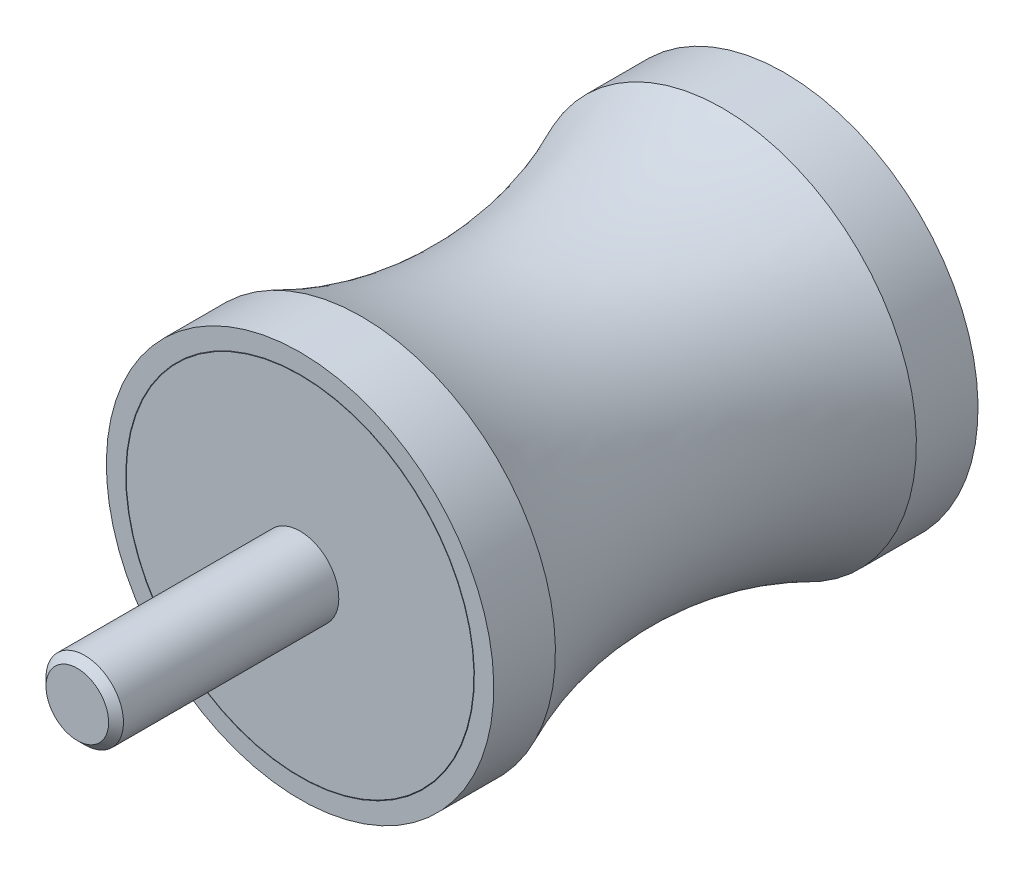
ISO-10303-21;
HEADER;
FILE_DESCRIPTION(('STEP AP214'),'2;1');
FILE_NAME('part.step','',(''),(''),'','','');
FILE_SCHEMA(('AUTOMOTIVE_DESIGN { 1 0 10303 214 1 1 1 1 }'));
ENDSEC;
DATA;
#1=APPLICATION_CONTEXT('core data for automotive mechanical design processes');
#2=APPLICATION_PROTOCOL_DEFINITION('international standard','automotive_design',2000,#1);
#3=PRODUCT_CONTEXT('',#1,'mechanical');
#4=PRODUCT('Part','Part','',(#3));
#5=PRODUCT_RELATED_PRODUCT_CATEGORY('part','',(#4));
#6=PRODUCT_DEFINITION_FORMATION('','',#4);
#7=PRODUCT_DEFINITION_CONTEXT('part definition',#1,'design');
#8=PRODUCT_DEFINITION('design','',#6,#7);
#9=PRODUCT_DEFINITION_SHAPE('','',#8);
#10=(LENGTH_UNIT() NAMED_UNIT(*) SI_UNIT(.MILLI.,.METRE.));
#11=(NAMED_UNIT(*) PLANE_ANGLE_UNIT() SI_UNIT($,.RADIAN.));
#12=(NAMED_UNIT(*) SI_UNIT($,.STERADIAN.) SOLID_ANGLE_UNIT());
#13=UNCERTAINTY_MEASURE_WITH_UNIT(LENGTH_MEASURE(1.E-05),#10,'distance_accuracy_value','');
#14=(GEOMETRIC_REPRESENTATION_CONTEXT(3) GLOBAL_UNCERTAINTY_ASSIGNED_CONTEXT((#13)) GLOBAL_UNIT_ASSIGNED_CONTEXT((#10,
#11,#12)) REPRESENTATION_CONTEXT('',''));
#15=CARTESIAN_POINT('',(0.,0.,0.));
#16=DIRECTION('',(0.,0.,1.));
#17=DIRECTION('',(1.,0.,0.));
#18=AXIS2_PLACEMENT_3D('',#15,#16,#17);
#19=CARTESIAN_POINT('',(0.,0.,0.5));
#20=DIRECTION('',(0.,0.,-1.));
#21=DIRECTION('',(0.,1.,0.));
#22=AXIS2_PLACEMENT_3D('',#19,#20,#21);
#23=CYLINDRICAL_SURFACE('',#22,18.);
#24=CARTESIAN_POINT('',(0.,0.,0.05));
#25=DIRECTION('',(0.,0.,-1.));
#26=DIRECTION('',(0.,1.,0.));
#27=AXIS2_PLACEMENT_3D('',#24,#25,#26);
#28=CIRCLE('',#27,18.);
#29=CARTESIAN_POINT('',(0.,18.,0.05));
#30=VERTEX_POINT('',#29);
#31=EDGE_CURVE('E53',#30,#30,#28,.T.);
#32=ORIENTED_EDGE('',*,*,#31,.F.);
#33=EDGE_LOOP('',(#32));
#34=FACE_BOUND('',#33,.T.);
#35=CARTESIAN_POINT('',(0.,0.,0.));
#36=DIRECTION('',(0.,0.,-1.));
#37=DIRECTION('',(0.,1.,0.));
#38=AXIS2_PLACEMENT_3D('',#35,#36,#37);
#39=CIRCLE('',#38,18.);
#40=CARTESIAN_POINT('',(0.,18.,0.));
#41=VERTEX_POINT('',#40);
#42=EDGE_CURVE('E44',#41,#41,#39,.T.);
#43=ORIENTED_EDGE('',*,*,#42,.T.);
#44=EDGE_LOOP('',(#43));
#45=FACE_BOUND('',#44,.T.);
#46=ADVANCED_FACE('F12',(#34,#45),#23,.F.);
#47=CARTESIAN_POINT('',(0.,0.,0.5));
#48=DIRECTION('',(0.,0.,-1.));
#49=DIRECTION('',(0.,1.,0.));
#50=AXIS2_PLACEMENT_3D('',#47,#48,#49);
#51=CYLINDRICAL_SURFACE('',#50,18.);
#52=CARTESIAN_POINT('',(0.,0.,50.));
#53=DIRECTION('',(0.,0.,-1.));
#54=DIRECTION('',(0.,1.,0.));
#55=AXIS2_PLACEMENT_3D('',#52,#53,#54);
#56=CIRCLE('',#55,18.);
#57=CARTESIAN_POINT('',(0.,18.,50.));
#58=VERTEX_POINT('',#57);
#59=EDGE_CURVE('E27',#58,#58,#56,.T.);
#60=ORIENTED_EDGE('',*,*,#59,.F.);
#61=EDGE_LOOP('',(#60));
#62=FACE_BOUND('',#61,.T.);
#63=CARTESIAN_POINT('',(0.,0.,49.95));
#64=DIRECTION('',(0.,0.,-1.));
#65=DIRECTION('',(0.,1.,0.));
#66=AXIS2_PLACEMENT_3D('',#63,#64,#65);
#67=CIRCLE('',#66,18.);
#68=CARTESIAN_POINT('',(0.,18.,49.95));
#69=VERTEX_POINT('',#68);
#70=EDGE_CURVE('E50',#69,#69,#67,.T.);
#71=ORIENTED_EDGE('',*,*,#70,.T.);
#72=EDGE_LOOP('',(#71));
#73=FACE_BOUND('',#72,.T.);
#74=ADVANCED_FACE('F89',(#62,#73),#51,.F.);
#75=CARTESIAN_POINT('',(18.,0.,50.));
#76=DIRECTION('',(0.,0.,-1.));
#77=DIRECTION('',(0.,1.,0.));
#78=AXIS2_PLACEMENT_3D('',#75,#76,#77);
#79=PLANE('',#78);
#80=CARTESIAN_POINT('',(0.,0.,50.));
#81=DIRECTION('',(0.,0.,-1.));
#82=DIRECTION('',(0.,1.,0.));
#83=AXIS2_PLACEMENT_3D('',#80,#81,#82);
#84=CIRCLE('',#83,20.);
#85=CARTESIAN_POINT('',(0.,20.,50.));
#86=VERTEX_POINT('',#85);
#87=EDGE_CURVE('E32',#86,#86,#84,.T.);
#88=ORIENTED_EDGE('',*,*,#87,.F.);
#89=EDGE_LOOP('',(#88));
#90=FACE_BOUND('',#89,.T.);
#91=ORIENTED_EDGE('',*,*,#59,.T.);
#92=EDGE_LOOP('',(#91));
#93=FACE_BOUND('',#92,.T.);
#94=ADVANCED_FACE('F115',(#90,#93),#79,.F.);
#95=CARTESIAN_POINT('',(0.,0.,0.5));
#96=DIRECTION('',(0.,0.,-1.));
#97=DIRECTION('',(0.,1.,0.));
#98=AXIS2_PLACEMENT_3D('',#95,#96,#97);
#99=CYLINDRICAL_SURFACE('',#98,20.);
#100=CARTESIAN_POINT('',(0.,0.,43.6338998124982));
#101=DIRECTION('',(0.,0.,-1.));
#102=DIRECTION('',(0.,1.,0.));
#103=AXIS2_PLACEMENT_3D('',#100,#101,#102);
#104=CIRCLE('',#103,20.);
#105=CARTESIAN_POINT('',(0.,20.,43.6338998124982));
#106=VERTEX_POINT('',#105);
#107=EDGE_CURVE('E35',#106,#106,#104,.T.);
#108=ORIENTED_EDGE('',*,*,#107,.F.);
#109=EDGE_LOOP('',(#108));
#110=FACE_BOUND('',#109,.T.);
#111=ORIENTED_EDGE('',*,*,#87,.T.);
#112=EDGE_LOOP('',(#111));
#113=FACE_BOUND('',#112,.T.);
#114=ADVANCED_FACE('F109',(#110,#113),#99,.T.);
#115=CARTESIAN_POINT('',(0.,0.,25.));
#116=DIRECTION('',(0.,0.,-1.));
#117=DIRECTION('',(0.,1.,0.));
#118=AXIS2_PLACEMENT_3D('',#115,#116,#117);
#119=TOROIDAL_SURFACE('',#118,61.4027777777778,45.4027777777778);
#120=CARTESIAN_POINT('',(0.,0.,6.36610018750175));
#121=DIRECTION('',(0.,0.,-1.));
#122=DIRECTION('',(0.,1.,0.));
#123=AXIS2_PLACEMENT_3D('',#120,#121,#122);
#124=CIRCLE('',#123,20.);
#125=CARTESIAN_POINT('',(0.,20.,6.36610018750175));
#126=VERTEX_POINT('',#125);
#127=EDGE_CURVE('E38',#126,#126,#124,.T.);
#128=ORIENTED_EDGE('',*,*,#127,.F.);
#129=EDGE_LOOP('',(#128));
#130=FACE_BOUND('',#129,.T.);
#131=ORIENTED_EDGE('',*,*,#107,.T.);
#132=EDGE_LOOP('',(#131));
#133=FACE_BOUND('',#132,.T.);
#134=ADVANCED_FACE('F103',(#130,#133),#119,.F.);
#135=CARTESIAN_POINT('',(0.,0.,0.5));
#136=DIRECTION('',(0.,0.,-1.));
#137=DIRECTION('',(0.,1.,0.));
#138=AXIS2_PLACEMENT_3D('',#135,#136,#137);
#139=CYLINDRICAL_SURFACE('',#138,20.);
#140=CARTESIAN_POINT('',(0.,0.,0.));
#141=DIRECTION('',(0.,0.,-1.));
#142=DIRECTION('',(0.,1.,0.));
#143=AXIS2_PLACEMENT_3D('',#140,#141,#142);
#144=CIRCLE('',#143,20.);
#145=CARTESIAN_POINT('',(0.,20.,0.));
#146=VERTEX_POINT('',#145);
#147=EDGE_CURVE('E41',#146,#146,#144,.T.);
#148=ORIENTED_EDGE('',*,*,#147,.F.);
#149=EDGE_LOOP('',(#148));
#150=FACE_BOUND('',#149,.T.);
#151=ORIENTED_EDGE('',*,*,#127,.T.);
#152=EDGE_LOOP('',(#151));
#153=FACE_BOUND('',#152,.T.);
#154=ADVANCED_FACE('F97',(#150,#153),#139,.T.);
#155=CARTESIAN_POINT('',(20.,0.,0.));
#156=DIRECTION('',(0.,0.,1.));
#157=DIRECTION('',(0.,-1.,0.));
#158=AXIS2_PLACEMENT_3D('',#155,#156,#157);
#159=PLANE('',#158);
#160=ORIENTED_EDGE('',*,*,#42,.F.);
#161=EDGE_LOOP('',(#160));
#162=FACE_BOUND('',#161,.T.);
#163=ORIENTED_EDGE('',*,*,#147,.T.);
#164=EDGE_LOOP('',(#163));
#165=FACE_BOUND('',#164,.T.);
#166=ADVANCED_FACE('F93',(#162,#165),#159,.F.);
#167=CARTESIAN_POINT('',(0.,0.,50.));
#168=DIRECTION('',(0.,0.,-1.));
#169=DIRECTION('',(0.,1.,0.));
#170=AXIS2_PLACEMENT_3D('',#167,#168,#169);
#171=PLANE('',#170);
#172=CARTESIAN_POINT('',(0.,0.,50.));
#173=DIRECTION('',(0.,0.,-1.));
#174=DIRECTION('',(0.,1.,0.));
#175=AXIS2_PLACEMENT_3D('',#172,#173,#174);
#176=CIRCLE('',#175,17.95);
#177=CARTESIAN_POINT('',(0.,17.95,50.));
#178=VERTEX_POINT('',#177);
#179=EDGE_CURVE('E47',#178,#178,#176,.T.);
#180=ORIENTED_EDGE('',*,*,#179,.F.);
#181=EDGE_LOOP('',(#180));
#182=FACE_BOUND('',#181,.T.);
#183=CARTESIAN_POINT('',(0.,0.,50.));
#184=DIRECTION('',(0.,0.,-1.));
#185=DIRECTION('',(0.,1.,0.));
#186=AXIS2_PLACEMENT_3D('',#183,#184,#185);
#187=CIRCLE('',#186,4.);
#188=CARTESIAN_POINT('',(0.,4.,50.));
#189=VERTEX_POINT('',#188);
#190=EDGE_CURVE('E8',#189,#189,#187,.T.);
#191=ORIENTED_EDGE('',*,*,#190,.T.);
#192=EDGE_LOOP('',(#191));
#193=FACE_BOUND('',#192,.T.);
#194=ADVANCED_FACE('F96',(#182,#193),#171,.F.);
#195=CARTESIAN_POINT('',(0.,0.,50.));
#196=DIRECTION('',(0.,0.,-1.));
#197=DIRECTION('',(0.,1.,0.));
#198=AXIS2_PLACEMENT_3D('',#195,#196,#197);
#199=CONICAL_SURFACE('',#198,17.95,0.785398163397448);
#200=ORIENTED_EDGE('',*,*,#70,.F.);
#201=EDGE_LOOP('',(#200));
#202=FACE_BOUND('',#201,.T.);
#203=ORIENTED_EDGE('',*,*,#179,.T.);
#204=EDGE_LOOP('',(#203));
#205=FACE_BOUND('',#204,.T.);
#206=ADVANCED_FACE('F129',(#202,#205),#199,.T.);
#207=CARTESIAN_POINT('',(0.,0.,73.));
#208=DIRECTION('',(0.,0.,-1.));
#209=DIRECTION('',(0.,1.,0.));
#210=AXIS2_PLACEMENT_3D('',#207,#208,#209);
#211=PLANE('',#210);
#212=CARTESIAN_POINT('',(0.,0.,73.));
#213=DIRECTION('',(0.,0.,-1.));
#214=DIRECTION('',(0.,1.,0.));
#215=AXIS2_PLACEMENT_3D('',#212,#213,#214);
#216=CIRCLE('',#215,3.233);
#217=CARTESIAN_POINT('',(0.,3.233,73.));
#218=VERTEX_POINT('',#217);
#219=EDGE_CURVE('E19',#218,#218,#216,.T.);
#220=ORIENTED_EDGE('',*,*,#219,.F.);
#221=EDGE_LOOP('',(#220));
#222=FACE_BOUND('',#221,.T.);
#223=ADVANCED_FACE('F14',(#222),#211,.F.);
#224=CARTESIAN_POINT('',(0.,0.,73.));
#225=DIRECTION('',(0.,0.,-1.));
#226=DIRECTION('',(0.,1.,0.));
#227=AXIS2_PLACEMENT_3D('',#224,#225,#226);
#228=CONICAL_SURFACE('',#227,3.233,0.785398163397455);
#229=CARTESIAN_POINT('',(0.,0.,72.233));
#230=DIRECTION('',(0.,0.,-1.));
#231=DIRECTION('',(0.,1.,0.));
#232=AXIS2_PLACEMENT_3D('',#229,#230,#231);
#233=CIRCLE('',#232,4.);
#234=CARTESIAN_POINT('',(0.,4.,72.233));
#235=VERTEX_POINT('',#234);
#236=EDGE_CURVE('E23',#235,#235,#233,.T.);
#237=ORIENTED_EDGE('',*,*,#236,.F.);
#238=EDGE_LOOP('',(#237));
#239=FACE_BOUND('',#238,.T.);
#240=ORIENTED_EDGE('',*,*,#219,.T.);
#241=EDGE_LOOP('',(#240));
#242=FACE_BOUND('',#241,.T.);
#243=ADVANCED_FACE('F142',(#239,#242),#228,.T.);
#244=CARTESIAN_POINT('',(0.,0.,0.5));
#245=DIRECTION('',(0.,0.,-1.));
#246=DIRECTION('',(0.,1.,0.));
#247=AXIS2_PLACEMENT_3D('',#244,#245,#246);
#248=CYLINDRICAL_SURFACE('',#247,4.);
#249=ORIENTED_EDGE('',*,*,#190,.F.);
#250=EDGE_LOOP('',(#249));
#251=FACE_BOUND('',#250,.T.);
#252=ORIENTED_EDGE('',*,*,#236,.T.);
#253=EDGE_LOOP('',(#252));
#254=FACE_BOUND('',#253,.T.);
#255=ADVANCED_FACE('F83',(#251,#254),#248,.T.);
#256=CARTESIAN_POINT('',(0.,0.,0.05));
#257=DIRECTION('',(0.,0.,1.));
#258=DIRECTION('',(0.,-1.,0.));
#259=AXIS2_PLACEMENT_3D('',#256,#257,#258);
#260=CONICAL_SURFACE('',#259,18.,0.785398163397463);
#261=CARTESIAN_POINT('',(0.,0.,0.));
#262=DIRECTION('',(0.,0.,-1.));
#263=DIRECTION('',(0.,1.,0.));
#264=AXIS2_PLACEMENT_3D('',#261,#262,#263);
#265=CIRCLE('',#264,17.95);
#266=CARTESIAN_POINT('',(0.,17.95,0.));
#267=VERTEX_POINT('',#266);
#268=EDGE_CURVE('E56',#267,#267,#265,.T.);
#269=ORIENTED_EDGE('',*,*,#268,.F.);
#270=EDGE_LOOP('',(#269));
#271=FACE_BOUND('',#270,.T.);
#272=ORIENTED_EDGE('',*,*,#31,.T.);
#273=EDGE_LOOP('',(#272));
#274=FACE_BOUND('',#273,.T.);
#275=ADVANCED_FACE('F77',(#271,#274),#260,.T.);
#276=CARTESIAN_POINT('',(17.95,0.,0.));
#277=DIRECTION('',(0.,0.,1.));
#278=DIRECTION('',(0.,-1.,0.));
#279=AXIS2_PLACEMENT_3D('',#276,#277,#278);
#280=PLANE('',#279);
#281=CARTESIAN_POINT('',(0.,0.,0.));
#282=DIRECTION('',(0.,0.,-1.));
#283=DIRECTION('',(0.,1.,0.));
#284=AXIS2_PLACEMENT_3D('',#281,#282,#283);
#285=CIRCLE('',#284,4.);
#286=CARTESIAN_POINT('',(0.,4.,0.));
#287=VERTEX_POINT('',#286);
#288=EDGE_CURVE('E60',#287,#287,#285,.T.);
#289=ORIENTED_EDGE('',*,*,#288,.F.);
#290=EDGE_LOOP('',(#289));
#291=FACE_BOUND('',#290,.T.);
#292=ORIENTED_EDGE('',*,*,#268,.T.);
#293=EDGE_LOOP('',(#292));
#294=FACE_BOUND('',#293,.T.);
#295=ADVANCED_FACE('F71',(#291,#294),#280,.F.);
#296=CARTESIAN_POINT('',(0.,0.,8.));
#297=DIRECTION('',(0.,0.,-1.));
#298=DIRECTION('',(0.,1.,0.));
#299=AXIS2_PLACEMENT_3D('',#296,#297,#298);
#300=CYLINDRICAL_SURFACE('',#299,4.);
#301=CARTESIAN_POINT('',(0.,0.,8.));
#302=DIRECTION('',(0.,0.,-1.));
#303=DIRECTION('',(0.,1.,0.));
#304=AXIS2_PLACEMENT_3D('',#301,#302,#303);
#305=CIRCLE('',#304,4.);
#306=CARTESIAN_POINT('',(0.,4.,8.));
#307=VERTEX_POINT('',#306);
#308=EDGE_CURVE('E59',#307,#307,#305,.T.);
#309=ORIENTED_EDGE('',*,*,#308,.F.);
#310=EDGE_LOOP('',(#309));
#311=FACE_BOUND('',#310,.T.);
#312=ORIENTED_EDGE('',*,*,#288,.T.);
#313=EDGE_LOOP('',(#312));
#314=FACE_BOUND('',#313,.T.);
#315=ADVANCED_FACE('F68',(#311,#314),#300,.F.);
#316=CARTESIAN_POINT('',(0.,0.,8.));
#317=DIRECTION('',(0.,0.,-1.));
#318=DIRECTION('',(0.,1.,0.));
#319=AXIS2_PLACEMENT_3D('',#316,#317,#318);
#320=PLANE('',#319);
#321=ORIENTED_EDGE('',*,*,#308,.T.);
#322=EDGE_LOOP('',(#321));
#323=FACE_BOUND('',#322,.T.);
#324=ADVANCED_FACE('F66',(#323),#320,.T.);
#325=CLOSED_SHELL('',(#46,#74,#94,#114,#134,#154,#166,#194,#206,#223,#243,#255,#275,#295,#315,#324));
#326=MANIFOLD_SOLID_BREP('B1',#325);
#327=ADVANCED_BREP_SHAPE_REPRESENTATION('',(#18,#326),#14);
#328=SHAPE_DEFINITION_REPRESENTATION(#9,#327);
ENDSEC;
END-ISO-10303-21;
